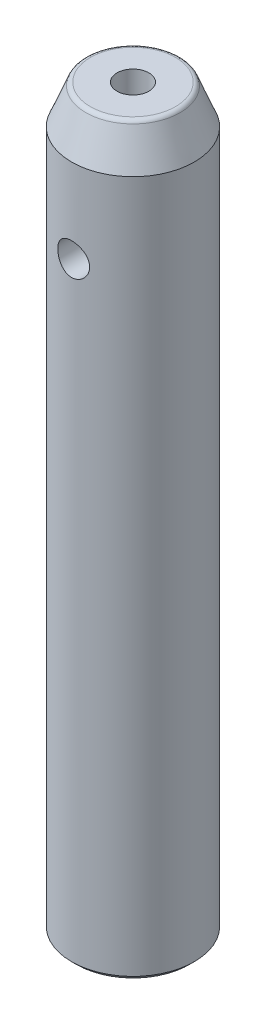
from build123d import *

# Parameters (mm, degrees)
SKETCH_1_R          = 6.35
EXTRUDE_1_DEPTH     = 76.2
M4X0_7_1_D          = 3.3
M4X0_7_1_DEPTH      = 10.1
M4X0_7_1_TIP        = 0.991420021
M6X1_0_1_D          = 5
M6X1_0_1_DEPTH      = 11
M6X1_0_1_TIP        = 1.502151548
CHAMFER_1_SIZE      = 4
CHAMFER_1_SIZE2     = 1.6
FILLET_1_R          = 0.5
CHAMFER_2_SIZE      = 0.5
SKETCH_6_R          = 1.65
CUT_EXTRUDE_1_DEPTH = 78.51162816


with BuildPart() as part:
    # Sketch 1 → Extrude 1 (new body)
    with BuildSketch(Plane(origin=(0, 0, 0), x_dir=(1, 0, 0), z_dir=(0, 1, 0))):
        with Locations(Location((0, 0, 0), (0, 0, 90))):
            Circle(SKETCH_1_R)
    extrude(amount=EXTRUDE_1_DEPTH)

    # M4x0.7 _1
    with Locations(Plane(origin=(0, 76.2, 0), x_dir=(1, 0, 0), z_dir=(0, 1, 0))):
        with Locations((0, 0)):
            Hole(M4X0_7_1_D / 2, depth=M4X0_7_1_DEPTH)
            with Locations((0, 0, -(M4X0_7_1_DEPTH + M4X0_7_1_TIP / 2))):  # 118° drill point
                Cone(0, M4X0_7_1_D / 2, M4X0_7_1_TIP, mode=Mode.SUBTRACT)

    # M6x1.0 _1
    with Locations(Plane(origin=(0, 0, 0), x_dir=(-1, 0, 0), z_dir=(0, -1, 0))):
        with Locations((0, 0)):
            Hole(M6X1_0_1_D / 2, depth=M6X1_0_1_DEPTH)
            with Locations((0, 0, -(M6X1_0_1_DEPTH + M6X1_0_1_TIP / 2))):  # 118° drill point
                Cone(0, M6X1_0_1_D / 2, M6X1_0_1_TIP, mode=Mode.SUBTRACT)

    # Chamfer 1
    chamfer_1_edges = [part.edges().sort_by_distance(p)[0] for p in [
        (0, 76.2, 6.35),
    ]]
    chamfer_1_side = [part.faces().sort_by_distance(p)[0] for p in [
        (0, 38.1, 6.35),
    ]]
    chamfer(chamfer_1_edges, length=CHAMFER_1_SIZE, length2=CHAMFER_1_SIZE2, reference=chamfer_1_side[0])

    # Fillet 1
    fillet_1_edges = [part.edges().sort_by_distance(p)[0] for p in [
        (0, 76.2, 4.75),
    ]]
    fillet(fillet_1_edges, radius=FILLET_1_R)

    # Chamfer 2
    chamfer_2_edges = [part.edges().sort_by_distance(p)[0] for p in [
        (0, 0, 6.35),
    ]]
    chamfer(chamfer_2_edges, length=CHAMFER_2_SIZE)

    # Sketch 6 → Cut-Extrude 1 (cut, through all)
    with BuildSketch(Plane.XY.offset(6.35)):
        with Locations(Location((0, 63.5, 0), (0, 0, 89.999999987))):
            Circle(SKETCH_6_R)
    extrude(amount=-CUT_EXTRUDE_1_DEPTH, mode=Mode.SUBTRACT)


solid = part.part
